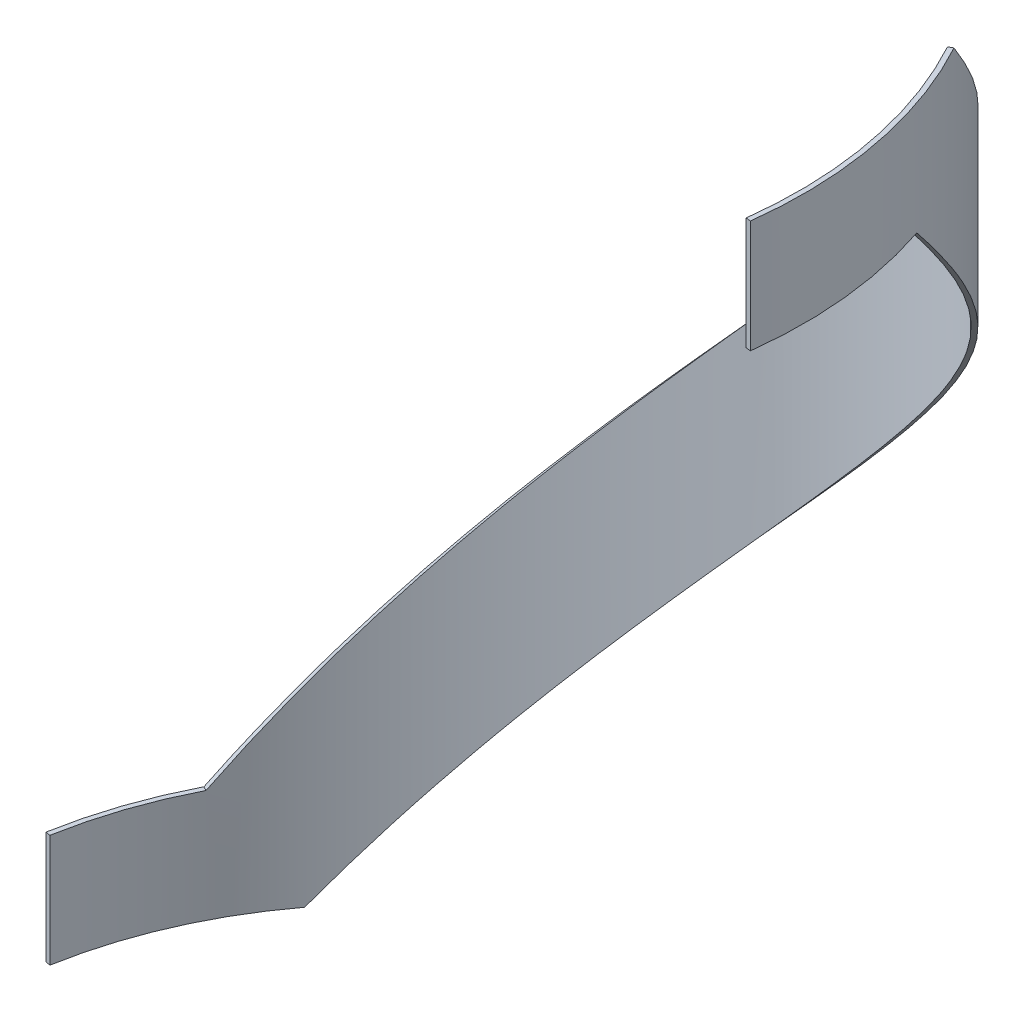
ISO-10303-21;
HEADER;
FILE_DESCRIPTION(('STEP AP214'),'2;1');
FILE_NAME('part.step','',(''),(''),'','','');
FILE_SCHEMA(('AUTOMOTIVE_DESIGN { 1 0 10303 214 1 1 1 1 }'));
ENDSEC;
DATA;
#1=APPLICATION_CONTEXT('core data for automotive mechanical design processes');
#2=APPLICATION_PROTOCOL_DEFINITION('international standard','automotive_design',2000,#1);
#3=PRODUCT_CONTEXT('',#1,'mechanical');
#4=PRODUCT('Part','Part','',(#3));
#5=PRODUCT_RELATED_PRODUCT_CATEGORY('part','',(#4));
#6=PRODUCT_DEFINITION_FORMATION('','',#4);
#7=PRODUCT_DEFINITION_CONTEXT('part definition',#1,'design');
#8=PRODUCT_DEFINITION('design','',#6,#7);
#9=PRODUCT_DEFINITION_SHAPE('','',#8);
#10=(LENGTH_UNIT() NAMED_UNIT(*) SI_UNIT(.MILLI.,.METRE.));
#11=(NAMED_UNIT(*) PLANE_ANGLE_UNIT() SI_UNIT($,.RADIAN.));
#12=(NAMED_UNIT(*) SI_UNIT($,.STERADIAN.) SOLID_ANGLE_UNIT());
#13=UNCERTAINTY_MEASURE_WITH_UNIT(LENGTH_MEASURE(1.E-05),#10,'distance_accuracy_value','');
#14=(GEOMETRIC_REPRESENTATION_CONTEXT(3) GLOBAL_UNCERTAINTY_ASSIGNED_CONTEXT((#13)) GLOBAL_UNIT_ASSIGNED_CONTEXT((#10,
#11,#12)) REPRESENTATION_CONTEXT('',''));
#15=CARTESIAN_POINT('',(0.,0.,0.));
#16=DIRECTION('',(0.,0.,1.));
#17=DIRECTION('',(1.,0.,0.));
#18=AXIS2_PLACEMENT_3D('',#15,#16,#17);
#19=CARTESIAN_POINT('',(-861.706783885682,-117.5,-151.942155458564));
#20=DIRECTION('',(-0.173648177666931,0.,0.984807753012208));
#21=DIRECTION('',(0.,1.,0.));
#22=AXIS2_PLACEMENT_3D('',#19,#20,#21);
#23=PLANE('',#22);
#24=DIRECTION('',(-0.984807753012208,0.,-0.173648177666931));
#25=VECTOR('',#24,1.);
#26=CARTESIAN_POINT('',(-861.706783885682,-235.,-151.942155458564));
#27=LINE('',#26,#25);
#28=CARTESIAN_POINT('',(-851.85870635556,-235.,-150.205673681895));
#29=VERTEX_POINT('',#28);
#30=CARTESIAN_POINT('',(-861.706783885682,-235.,-151.942155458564));
#31=VERTEX_POINT('',#30);
#32=EDGE_CURVE('E12',#29,#31,#27,.T.);
#33=ORIENTED_EDGE('',*,*,#32,.F.);
#34=DIRECTION('',(0.,-1.,0.));
#35=VECTOR('',#34,1.);
#36=CARTESIAN_POINT('',(-851.85870635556,3445.3749663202,-150.205673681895));
#37=LINE('',#36,#35);
#38=CARTESIAN_POINT('',(-851.85870635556,0.,-150.205673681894));
#39=VERTEX_POINT('',#38);
#40=EDGE_CURVE('E102',#29,#39,#37,.F.);
#41=ORIENTED_EDGE('',*,*,#40,.T.);
#42=DIRECTION('',(-0.984807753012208,0.,-0.17364817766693));
#43=VECTOR('',#42,1.);
#44=CARTESIAN_POINT('',(-861.706783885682,0.,-151.942155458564));
#45=LINE('',#44,#43);
#46=CARTESIAN_POINT('',(-861.706783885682,0.,-151.942155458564));
#47=VERTEX_POINT('',#46);
#48=EDGE_CURVE('E61',#39,#47,#45,.T.);
#49=ORIENTED_EDGE('',*,*,#48,.T.);
#50=DIRECTION('',(0.,1.,0.));
#51=VECTOR('',#50,1.);
#52=CARTESIAN_POINT('',(-861.706783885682,-235.,-151.942155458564));
#53=LINE('',#52,#51);
#54=EDGE_CURVE('E105',#31,#47,#53,.T.);
#55=ORIENTED_EDGE('',*,*,#54,.F.);
#56=EDGE_LOOP('',(#33,#41,#49,#55));
#57=FACE_BOUND('',#56,.T.);
#58=ADVANCED_FACE('F49',(#57),#23,.T.);
#59=CARTESIAN_POINT('',(1.11022302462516E-13,0.,0.));
#60=DIRECTION('',(0.,1.,0.));
#61=DIRECTION('',(0.,0.,1.));
#62=AXIS2_PLACEMENT_3D('',#59,#60,#61);
#63=PLANE('',#62);
#64=ORIENTED_EDGE('',*,*,#48,.F.);
#65=CARTESIAN_POINT('',(1.11022302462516E-13,0.,0.));
#66=DIRECTION('',(0.,-1.,0.));
#67=DIRECTION('',(0.,0.,-1.));
#68=AXIS2_PLACEMENT_3D('',#65,#66,#67);
#69=CIRCLE('',#68,865.);
#70=CARTESIAN_POINT('',(-769.87668269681,0.,-394.353766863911));
#71=VERTEX_POINT('',#70);
#72=EDGE_CURVE('E118',#39,#71,#69,.T.);
#73=ORIENTED_EDGE('',*,*,#72,.T.);
#74=CARTESIAN_POINT('',(-778.776991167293,0.,-398.912769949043));
#75=CARTESIAN_POINT('',(-769.87668269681,0.,-394.353766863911));
#76=B_SPLINE_CURVE_WITH_KNOTS('',1,(#74,#75),.UNSPECIFIED.,.F.,.F.,(2,2),(0.,1.),.UNSPECIFIED.);
#77=CARTESIAN_POINT('',(-778.776991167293,0.,-398.912769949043));
#78=VERTEX_POINT('',#77);
#79=EDGE_CURVE('E330',#71,#78,#76,.F.);
#80=ORIENTED_EDGE('',*,*,#79,.T.);
#81=CARTESIAN_POINT('',(1.11022302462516E-13,0.,0.));
#82=DIRECTION('',(0.,-1.,0.));
#83=DIRECTION('',(0.,0.,1.));
#84=AXIS2_PLACEMENT_3D('',#81,#82,#83);
#85=CIRCLE('',#84,875.);
#86=EDGE_CURVE('E122',#47,#78,#85,.T.);
#87=ORIENTED_EDGE('',*,*,#86,.F.);
#88=EDGE_LOOP('',(#64,#73,#80,#87));
#89=FACE_BOUND('',#88,.T.);
#90=ADVANCED_FACE('F212',(#89),#63,.T.);
#91=CARTESIAN_POINT('',(-778.776991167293,0.,-398.912769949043));
#92=CARTESIAN_POINT('',(-760.754896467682,43.7500507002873,-434.0963833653));
#93=CARTESIAN_POINT('',(-740.345017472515,87.5000000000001,-468.056550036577));
#94=CARTESIAN_POINT('',(-695.12345401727,175.,-532.908118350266));
#95=CARTESIAN_POINT('',(-670.312044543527,218.75,-563.799114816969));
#96=CARTESIAN_POINT('',(-616.742489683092,306.25,-621.945640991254));
#97=CARTESIAN_POINT('',(-587.984645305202,350.,-649.200843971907));
#98=CARTESIAN_POINT('',(-527.049636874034,437.5,-699.575842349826));
#99=CARTESIAN_POINT('',(-494.872815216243,481.25,-722.695354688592));
#100=CARTESIAN_POINT('',(-427.689983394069,568.75,-764.37487990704));
#101=CARTESIAN_POINT('',(-392.684350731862,612.5,-782.934658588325));
#102=CARTESIAN_POINT('',(-320.485919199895,700.,-815.154251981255));
#103=CARTESIAN_POINT('',(-283.293526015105,743.75,-828.81388565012));
#104=CARTESIAN_POINT('',(-207.403711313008,831.25,-850.98259645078));
#105=CARTESIAN_POINT('',(-168.706716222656,875.,-859.49154901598));
#106=CARTESIAN_POINT('',(-90.5174398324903,962.5,-871.202773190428));
#107=CARTESIAN_POINT('',(-51.0255978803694,1006.25,-874.404978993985));
#108=CARTESIAN_POINT('',(28.0290434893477,1093.75,-875.44391690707));
#109=CARTESIAN_POINT('',(67.5913986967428,1137.5,-873.280643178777));
#110=CARTESIAN_POINT('',(146.061436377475,1225.,-863.628239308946));
#111=CARTESIAN_POINT('',(184.968677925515,1268.75,-856.13916340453));
#112=CARTESIAN_POINT('',(261.41486566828,1356.25,-835.972455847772));
#113=CARTESIAN_POINT('',(298.953382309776,1400.,-823.294937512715));
#114=CARTESIAN_POINT('',(371.973594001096,1487.5,-792.983810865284));
#115=CARTESIAN_POINT('',(407.454878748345,1531.25,-775.350372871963));
#116=CARTESIAN_POINT('',(475.709825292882,1618.75,-735.450774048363));
#117=CARTESIAN_POINT('',(508.483103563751,1662.5,-713.184837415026));
#118=CARTESIAN_POINT('',(570.72089725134,1750.,-664.428578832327));
#119=CARTESIAN_POINT('',(600.185062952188,1793.75,-637.938530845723));
#120=CARTESIAN_POINT('',(655.264178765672,1881.25,-581.219867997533));
#121=CARTESIAN_POINT('',(680.878819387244,1925.,-550.991571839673));
#122=CARTESIAN_POINT('',(727.78903210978,2012.5,-487.350801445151));
#123=CARTESIAN_POINT('',(749.084318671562,2056.24994929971,-453.938725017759));
#124=CARTESIAN_POINT('',(768.0247971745,2100.,-419.24087458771));
#125=CARTESIAN_POINT('',(-769.87668269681,0.,-394.353766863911));
#126=CARTESIAN_POINT('',(-752.060555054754,43.7500500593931,-429.135281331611));
#127=CARTESIAN_POINT('',(-731.883931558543,87.5000000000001,-462.707332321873));
#128=CARTESIAN_POINT('',(-687.179185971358,175.,-526.817739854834));
#129=CARTESIAN_POINT('',(-662.651335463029,218.75,-557.355696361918));
#130=CARTESIAN_POINT('',(-609.694004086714,306.25,-614.837690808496));
#131=CARTESIAN_POINT('',(-581.264820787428,350.,-641.781405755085));
#132=CARTESIAN_POINT('',(-521.026212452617,437.5,-691.580689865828));
#133=CARTESIAN_POINT('',(-489.217125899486,481.25,-714.435979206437));
#134=CARTESIAN_POINT('',(-422.802097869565,568.75,-755.639166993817));
#135=CARTESIAN_POINT('',(-388.19652958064,612.5,-773.986833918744));
#136=CARTESIAN_POINT('',(-316.823222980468,700.,-805.838203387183));
#137=CARTESIAN_POINT('',(-280.055885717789,743.75,-819.341726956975));
#138=CARTESIAN_POINT('',(-205.033383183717,831.25,-841.257081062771));
#139=CARTESIAN_POINT('',(-166.778639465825,875.,-849.668788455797));
#140=CARTESIAN_POINT('',(-89.4829548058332,962.5,-861.246170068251));
#141=CARTESIAN_POINT('',(-50.442448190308,1006.25,-864.411779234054));
#142=CARTESIAN_POINT('',(27.7087115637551,1093.75,-865.438843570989));
#143=CARTESIAN_POINT('',(66.81892556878,1137.5,-863.30029297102));
#144=CARTESIAN_POINT('',(144.392162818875,1225.,-853.758202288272));
#145=CARTESIAN_POINT('',(182.854750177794,1268.75,-846.354715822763));
#146=CARTESIAN_POINT('',(258.427267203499,1356.25,-826.418484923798));
#147=CARTESIAN_POINT('',(295.536772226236,1400.,-813.88585251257));
#148=CARTESIAN_POINT('',(367.722467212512,1487.5,-783.921138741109));
#149=CARTESIAN_POINT('',(402.798251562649,1531.25,-766.489225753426));
#150=CARTESIAN_POINT('',(470.273141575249,1618.75,-727.045622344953));
#151=CARTESIAN_POINT('',(502.671868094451,1662.5,-705.034153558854));
#152=CARTESIAN_POINT('',(564.198372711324,1750.,-656.835109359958));
#153=CARTESIAN_POINT('',(593.325805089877,1793.75,-630.647804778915));
#154=CARTESIAN_POINT('',(647.775445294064,1881.25,-574.577355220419));
#155=CARTESIAN_POINT('',(673.097347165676,1925.,-544.694525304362));
#156=CARTESIAN_POINT('',(719.471443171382,2012.5,-481.781078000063));
#157=CARTESIAN_POINT('',(740.523355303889,2056.24994994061,-448.75085337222));
#158=CARTESIAN_POINT('',(759.247370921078,2100.,-414.449550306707));
#159=B_SPLINE_SURFACE_WITH_KNOTS('',1,3,((#91,#92,#93,#94,#95,#96,#97,#98,#99,#100,#101,#102,
#103,#104,#105,#106,#107,#108,#109,#110,#111,#112,#113,#114,#115,#116,#117,#118,#119,#120,#121,
#122,#123,#124),(#125,#126,#127,#128,#129,#130,#131,#132,#133,#134,#135,#136,#137,#138,#139,
#140,#141,#142,#143,#144,#145,#146,#147,#148,#149,#150,#151,#152,#153,#154,#155,#156,#157,
#158)),.UNSPECIFIED.,.F.,.F.,.F.,(2,2),(4,2,2,2,2,2,2,2,2,2,2,2,2,2,2,2,4),(0.,1.),(0.,0.0625,
0.125,0.1875,0.25,0.3125,0.375,0.4375,0.5,0.5625,0.625,0.6875,0.75,0.8125,0.875,0.9375,1.),.UNSPECIFIED.);
#160=CARTESIAN_POINT('',(-769.87668269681,0.,-394.353766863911));
#161=CARTESIAN_POINT('',(-752.060555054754,43.7500500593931,-429.135281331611));
#162=CARTESIAN_POINT('',(-731.883931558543,87.5000000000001,-462.707332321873));
#163=CARTESIAN_POINT('',(-687.179185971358,175.,-526.817739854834));
#164=CARTESIAN_POINT('',(-662.651335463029,218.75,-557.355696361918));
#165=CARTESIAN_POINT('',(-609.694004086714,306.25,-614.837690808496));
#166=CARTESIAN_POINT('',(-581.264820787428,350.,-641.781405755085));
#167=CARTESIAN_POINT('',(-521.026212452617,437.5,-691.580689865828));
#168=CARTESIAN_POINT('',(-489.217125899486,481.25,-714.435979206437));
#169=CARTESIAN_POINT('',(-422.802097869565,568.75,-755.639166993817));
#170=CARTESIAN_POINT('',(-388.19652958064,612.5,-773.986833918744));
#171=CARTESIAN_POINT('',(-316.823222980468,700.,-805.838203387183));
#172=CARTESIAN_POINT('',(-280.055885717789,743.75,-819.341726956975));
#173=CARTESIAN_POINT('',(-205.033383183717,831.25,-841.257081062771));
#174=CARTESIAN_POINT('',(-166.778639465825,875.,-849.668788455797));
#175=CARTESIAN_POINT('',(-89.4829548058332,962.5,-861.246170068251));
#176=CARTESIAN_POINT('',(-50.442448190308,1006.25,-864.411779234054));
#177=CARTESIAN_POINT('',(27.7087115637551,1093.75,-865.438843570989));
#178=CARTESIAN_POINT('',(66.81892556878,1137.5,-863.30029297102));
#179=CARTESIAN_POINT('',(144.392162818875,1225.,-853.758202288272));
#180=CARTESIAN_POINT('',(182.854750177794,1268.75,-846.354715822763));
#181=CARTESIAN_POINT('',(258.427267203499,1356.25,-826.418484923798));
#182=CARTESIAN_POINT('',(295.536772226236,1400.,-813.88585251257));
#183=CARTESIAN_POINT('',(367.722467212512,1487.5,-783.921138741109));
#184=CARTESIAN_POINT('',(402.798251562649,1531.25,-766.489225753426));
#185=CARTESIAN_POINT('',(470.273141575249,1618.75,-727.045622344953));
#186=CARTESIAN_POINT('',(502.671868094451,1662.5,-705.034153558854));
#187=CARTESIAN_POINT('',(564.198372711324,1750.,-656.835109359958));
#188=CARTESIAN_POINT('',(593.325805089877,1793.75,-630.647804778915));
#189=CARTESIAN_POINT('',(647.775445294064,1881.25,-574.577355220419));
#190=CARTESIAN_POINT('',(673.097347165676,1925.,-544.694525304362));
#191=CARTESIAN_POINT('',(719.471443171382,2012.5,-481.781078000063));
#192=CARTESIAN_POINT('',(740.523355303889,2056.24994994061,-448.75085337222));
#193=CARTESIAN_POINT('',(759.247370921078,2100.,-414.449550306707));
#194=B_SPLINE_CURVE_WITH_KNOTS('',3,(#160,#161,#162,#163,#164,#165,#166,#167,#168,#169,#170,
#171,#172,#173,#174,#175,#176,#177,#178,#179,#180,#181,#182,#183,#184,#185,#186,#187,#188,#189,
#190,#191,#192,#193),.UNSPECIFIED.,.F.,.F.,(4,2,2,2,2,2,2,2,2,2,2,2,2,2,2,2,4),(0.,0.0625,0.125,
0.1875,0.25,0.3125,0.375,0.4375,0.5,0.5625,0.625,0.6875,0.75,0.8125,0.875,0.9375,1.),.UNSPECIFIED.);
#195=CARTESIAN_POINT('',(759.247370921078,2100.,-414.449550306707));
#196=VERTEX_POINT('',#195);
#197=EDGE_CURVE('E284',#71,#196,#194,.T.);
#198=CARTESIAN_POINT('',(759.247370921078,2100.,-414.449550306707));
#199=CARTESIAN_POINT('',(768.0247971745,2100.,-419.24087458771));
#200=B_SPLINE_CURVE_WITH_KNOTS('',1,(#198,#199),.UNSPECIFIED.,.F.,.F.,(2,2),(0.,1.),.UNSPECIFIED.);
#201=CARTESIAN_POINT('',(768.0247971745,2100.,-419.24087458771));
#202=VERTEX_POINT('',#201);
#203=EDGE_CURVE('E186',#196,#202,#200,.T.);
#204=CARTESIAN_POINT('',(768.0247971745,2100.,-419.24087458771));
#205=CARTESIAN_POINT('',(749.084318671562,2056.24994929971,-453.938725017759));
#206=CARTESIAN_POINT('',(727.78903210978,2012.5,-487.350801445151));
#207=CARTESIAN_POINT('',(680.878819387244,1925.,-550.991571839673));
#208=CARTESIAN_POINT('',(655.264178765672,1881.25,-581.219867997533));
#209=CARTESIAN_POINT('',(600.185062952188,1793.75,-637.938530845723));
#210=CARTESIAN_POINT('',(570.72089725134,1750.,-664.428578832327));
#211=CARTESIAN_POINT('',(508.483103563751,1662.5,-713.184837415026));
#212=CARTESIAN_POINT('',(475.709825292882,1618.75,-735.450774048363));
#213=CARTESIAN_POINT('',(407.454878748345,1531.25,-775.350372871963));
#214=CARTESIAN_POINT('',(371.973594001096,1487.5,-792.983810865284));
#215=CARTESIAN_POINT('',(298.953382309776,1400.,-823.294937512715));
#216=CARTESIAN_POINT('',(261.41486566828,1356.25,-835.972455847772));
#217=CARTESIAN_POINT('',(184.968677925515,1268.75,-856.13916340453));
#218=CARTESIAN_POINT('',(146.061436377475,1225.,-863.628239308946));
#219=CARTESIAN_POINT('',(67.5913986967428,1137.5,-873.280643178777));
#220=CARTESIAN_POINT('',(28.0290434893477,1093.75,-875.44391690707));
#221=CARTESIAN_POINT('',(-51.0255978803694,1006.25,-874.404978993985));
#222=CARTESIAN_POINT('',(-90.5174398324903,962.5,-871.202773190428));
#223=CARTESIAN_POINT('',(-168.706716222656,875.,-859.49154901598));
#224=CARTESIAN_POINT('',(-207.403711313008,831.25,-850.98259645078));
#225=CARTESIAN_POINT('',(-283.293526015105,743.75,-828.81388565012));
#226=CARTESIAN_POINT('',(-320.485919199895,700.,-815.154251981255));
#227=CARTESIAN_POINT('',(-392.684350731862,612.5,-782.934658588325));
#228=CARTESIAN_POINT('',(-427.689983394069,568.75,-764.37487990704));
#229=CARTESIAN_POINT('',(-494.872815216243,481.25,-722.695354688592));
#230=CARTESIAN_POINT('',(-527.049636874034,437.5,-699.575842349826));
#231=CARTESIAN_POINT('',(-587.984645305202,350.,-649.200843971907));
#232=CARTESIAN_POINT('',(-616.742489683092,306.25,-621.945640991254));
#233=CARTESIAN_POINT('',(-670.312044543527,218.75,-563.799114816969));
#234=CARTESIAN_POINT('',(-695.12345401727,175.,-532.908118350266));
#235=CARTESIAN_POINT('',(-740.345017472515,87.5000000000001,-468.056550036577));
#236=CARTESIAN_POINT('',(-760.754896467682,43.7500507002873,-434.0963833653));
#237=CARTESIAN_POINT('',(-778.776991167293,0.,-398.912769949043));
#238=B_SPLINE_CURVE_WITH_KNOTS('',3,(#204,#205,#206,#207,#208,#209,#210,#211,#212,#213,#214,
#215,#216,#217,#218,#219,#220,#221,#222,#223,#224,#225,#226,#227,#228,#229,#230,#231,#232,#233,
#234,#235,#236,#237),.UNSPECIFIED.,.F.,.F.,(4,2,2,2,2,2,2,2,2,2,2,2,2,2,2,2,4),(0.,0.0625,0.125,
0.1875,0.25,0.3125,0.375,0.4375,0.5,0.5625,0.625,0.6875,0.75,0.8125,0.875,0.9375,1.),.UNSPECIFIED.);
#239=EDGE_CURVE('E310',#78,#202,#238,.F.);
#240=ORIENTED_EDGE('',*,*,#79,.F.);
#241=ORIENTED_EDGE('',*,*,#197,.T.);
#242=ORIENTED_EDGE('',*,*,#203,.T.);
#243=ORIENTED_EDGE('',*,*,#239,.F.);
#244=EDGE_LOOP('',(#240,#241,#242,#243));
#245=FACE_BOUND('',#244,.T.);
#246=ADVANCED_FACE('F199',(#245),#159,.T.);
#247=CARTESIAN_POINT('',(1.11022302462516E-13,2100.,0.));
#248=DIRECTION('',(0.,1.,0.));
#249=DIRECTION('',(0.,0.,1.));
#250=AXIS2_PLACEMENT_3D('',#247,#248,#249);
#251=PLANE('',#250);
#252=ORIENTED_EDGE('',*,*,#203,.F.);
#253=CARTESIAN_POINT('',(1.11022302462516E-13,2100.,0.));
#254=DIRECTION('',(0.,-1.,0.));
#255=DIRECTION('',(0.,0.,-1.));
#256=AXIS2_PLACEMENT_3D('',#253,#254,#255);
#257=CIRCLE('',#256,865.);
#258=CARTESIAN_POINT('',(858.552421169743,2100.,105.416982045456));
#259=VERTEX_POINT('',#258);
#260=EDGE_CURVE('E279',#196,#259,#257,.T.);
#261=ORIENTED_EDGE('',*,*,#260,.T.);
#262=DIRECTION('',(0.992546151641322,0.,0.121869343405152));
#263=VECTOR('',#262,1.);
#264=CARTESIAN_POINT('',(868.477882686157,2100.,106.635675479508));
#265=LINE('',#264,#263);
#266=CARTESIAN_POINT('',(868.477882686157,2100.,106.635675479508));
#267=VERTEX_POINT('',#266);
#268=EDGE_CURVE('E182',#259,#267,#265,.T.);
#269=ORIENTED_EDGE('',*,*,#268,.T.);
#270=CARTESIAN_POINT('',(1.11022302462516E-13,2100.,0.));
#271=DIRECTION('',(0.,-1.,0.));
#272=DIRECTION('',(0.,0.,-1.));
#273=AXIS2_PLACEMENT_3D('',#270,#271,#272);
#274=CIRCLE('',#273,875.);
#275=EDGE_CURVE('E260',#202,#267,#274,.T.);
#276=ORIENTED_EDGE('',*,*,#275,.F.);
#277=EDGE_LOOP('',(#252,#261,#269,#276));
#278=FACE_BOUND('',#277,.T.);
#279=ADVANCED_FACE('F211',(#278),#251,.T.);
#280=CARTESIAN_POINT('',(868.477882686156,1982.5,106.635675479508));
#281=DIRECTION('',(-0.121869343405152,0.,0.992546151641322));
#282=DIRECTION('',(0.,-1.,0.));
#283=AXIS2_PLACEMENT_3D('',#280,#281,#282);
#284=PLANE('',#283);
#285=ORIENTED_EDGE('',*,*,#268,.F.);
#286=DIRECTION('',(0.,-1.,0.));
#287=VECTOR('',#286,1.);
#288=CARTESIAN_POINT('',(858.552421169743,3445.3749663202,105.416982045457));
#289=LINE('',#288,#287);
#290=CARTESIAN_POINT('',(858.552421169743,1865.,105.416982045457));
#291=VERTEX_POINT('',#290);
#292=EDGE_CURVE('E277',#259,#291,#289,.T.);
#293=ORIENTED_EDGE('',*,*,#292,.T.);
#294=DIRECTION('',(0.992546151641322,0.,0.121869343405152));
#295=VECTOR('',#294,1.);
#296=CARTESIAN_POINT('',(868.477882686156,1865.,106.635675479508));
#297=LINE('',#296,#295);
#298=CARTESIAN_POINT('',(868.477882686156,1865.,106.635675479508));
#299=VERTEX_POINT('',#298);
#300=EDGE_CURVE('E174',#291,#299,#297,.T.);
#301=ORIENTED_EDGE('',*,*,#300,.T.);
#302=DIRECTION('',(0.,-1.,0.));
#303=VECTOR('',#302,1.);
#304=CARTESIAN_POINT('',(868.477882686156,2100.,106.635675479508));
#305=LINE('',#304,#303);
#306=EDGE_CURVE('E256',#267,#299,#305,.T.);
#307=ORIENTED_EDGE('',*,*,#306,.F.);
#308=EDGE_LOOP('',(#285,#293,#301,#307));
#309=FACE_BOUND('',#308,.T.);
#310=ADVANCED_FACE('F339',(#309),#284,.T.);
#311=CARTESIAN_POINT('',(1.11022302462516E-13,1865.,0.));
#312=DIRECTION('',(0.,-1.,0.));
#313=DIRECTION('',(0.,0.,-1.));
#314=AXIS2_PLACEMENT_3D('',#311,#312,#313);
#315=PLANE('',#314);
#316=ORIENTED_EDGE('',*,*,#300,.F.);
#317=CARTESIAN_POINT('',(1.11022302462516E-13,1865.,0.));
#318=DIRECTION('',(0.,-1.,0.));
#319=DIRECTION('',(0.,0.,-1.));
#320=AXIS2_PLACEMENT_3D('',#317,#318,#319);
#321=CIRCLE('',#320,865.);
#322=CARTESIAN_POINT('',(819.25048614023,1865.,-277.58537598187));
#323=VERTEX_POINT('',#322);
#324=EDGE_CURVE('E124',#291,#323,#321,.F.);
#325=ORIENTED_EDGE('',*,*,#324,.T.);
#326=CARTESIAN_POINT('',(828.721590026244,1865.,-280.794455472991));
#327=CARTESIAN_POINT('',(819.25048614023,1865.,-277.585375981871));
#328=B_SPLINE_CURVE_WITH_KNOTS('',1,(#326,#327),.UNSPECIFIED.,.F.,.F.,(2,2),(0.,1.),.UNSPECIFIED.);
#329=CARTESIAN_POINT('',(828.721590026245,1865.,-280.79445547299));
#330=VERTEX_POINT('',#329);
#331=EDGE_CURVE('E183',#323,#330,#328,.F.);
#332=ORIENTED_EDGE('',*,*,#331,.T.);
#333=CARTESIAN_POINT('',(1.11022302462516E-13,1865.,0.));
#334=DIRECTION('',(0.,1.,0.));
#335=DIRECTION('',(0.,0.,-1.));
#336=AXIS2_PLACEMENT_3D('',#333,#334,#335);
#337=CIRCLE('',#336,875.);
#338=EDGE_CURVE('E249',#299,#330,#337,.T.);
#339=ORIENTED_EDGE('',*,*,#338,.F.);
#340=EDGE_LOOP('',(#316,#325,#332,#339));
#341=FACE_BOUND('',#340,.T.);
#342=ADVANCED_FACE('F150',(#341),#315,.T.);
#343=CARTESIAN_POINT('',(828.721590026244,1865.,-280.794455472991));
#344=CARTESIAN_POINT('',(816.035848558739,1821.24994929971,-318.234467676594));
#345=CARTESIAN_POINT('',(800.80913766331,1777.5,-354.813195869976));
#346=CARTESIAN_POINT('',(765.552626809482,1690.,-425.57825897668));
#347=CARTESIAN_POINT('',(745.523039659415,1646.25,-459.764152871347));
#348=CARTESIAN_POINT('',(701.028123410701,1558.75,-525.116414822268));
#349=CARTESIAN_POINT('',(676.563044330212,1515.,-556.282415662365));
#350=CARTESIAN_POINT('',(623.645819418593,1427.5,-615.023227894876));
#351=CARTESIAN_POINT('',(595.193970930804,1383.75,-642.59770922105));
#352=CARTESIAN_POINT('',(534.825010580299,1296.25,-693.649686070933));
#353=CARTESIAN_POINT('',(502.908237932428,1252.5,-717.126894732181));
#354=CARTESIAN_POINT('',(436.194790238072,1165.,-759.553674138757));
#355=CARTESIAN_POINT('',(401.398490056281,1121.25,-778.503006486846));
#356=CARTESIAN_POINT('',(329.564169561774,1033.75,-811.526424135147));
#357=CARTESIAN_POINT('',(292.526552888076,990.,-825.600323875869));
#358=CARTESIAN_POINT('',(216.888897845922,902.500000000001,-848.614685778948));
#359=CARTESIAN_POINT('',(178.289284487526,858.75,-857.555018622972));
#360=CARTESIAN_POINT('',(100.235591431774,771.25,-870.138210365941));
#361=CARTESIAN_POINT('',(60.7819503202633,727.5,-873.780998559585));
#362=CARTESIAN_POINT('',(-18.256170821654,640.,-875.702227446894));
#363=CARTESIAN_POINT('',(-57.840206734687,596.25,-873.980657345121));
#364=CARTESIAN_POINT('',(-136.413090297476,508.75,-865.204685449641));
#365=CARTESIAN_POINT('',(-175.401496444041,465.,-858.150332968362));
#366=CARTESIAN_POINT('',(-252.068009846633,377.5,-838.838123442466));
#367=CARTESIAN_POINT('',(-289.745686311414,333.75,-826.580374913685));
#368=CARTESIAN_POINT('',(-363.099662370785,246.25,-797.086139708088));
#369=CARTESIAN_POINT('',(-398.775549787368,202.5,-779.849818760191));
#370=CARTESIAN_POINT('',(-467.47157771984,115.,-740.714521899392));
#371=CARTESIAN_POINT('',(-500.49133223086,71.2500000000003,-718.815765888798));
#372=CARTESIAN_POINT('',(-563.269434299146,-16.2499999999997,-670.757201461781));
#373=CARTESIAN_POINT('',(-593.027429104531,-60.0000000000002,-644.597663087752));
#374=CARTESIAN_POINT('',(-648.736170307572,-147.5,-588.497289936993));
#375=CARTESIAN_POINT('',(-674.686576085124,-191.249949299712,-558.556806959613));
#376=CARTESIAN_POINT('',(-698.495407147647,-235.,-527.000157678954));
#377=CARTESIAN_POINT('',(819.25048614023,1865.,-277.585375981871));
#378=CARTESIAN_POINT('',(806.70972475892,1821.24994994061,-314.597501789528));
#379=CARTESIAN_POINT('',(791.657033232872,1777.5,-350.758187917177));
#380=CARTESIAN_POINT('',(756.80345393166,1690.,-420.714507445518));
#381=CARTESIAN_POINT('',(737.002776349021,1646.25,-454.50970540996));
#382=CARTESIAN_POINT('',(693.016373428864,1558.75,-519.115084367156));
#383=CARTESIAN_POINT('',(668.830895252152,1515.,-549.92490234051));
#384=CARTESIAN_POINT('',(616.518438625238,1427.5,-607.994391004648));
#385=CARTESIAN_POINT('',(588.391754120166,1383.75,-635.253735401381));
#386=CARTESIAN_POINT('',(528.712724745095,1296.25,-685.722261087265));
#387=CARTESIAN_POINT('',(497.1607152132,1252.5,-708.931158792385));
#388=CARTESIAN_POINT('',(431.209706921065,1165.,-750.873060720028));
#389=CARTESIAN_POINT('',(396.811078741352,1121.25,-769.605829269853));
#390=CARTESIAN_POINT('',(325.797721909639,1033.75,-802.251836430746));
#391=CARTESIAN_POINT('',(289.183392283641,990.,-816.164891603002));
#392=CARTESIAN_POINT('',(214.410167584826,902.500000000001,-838.916232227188));
#393=CARTESIAN_POINT('',(176.251692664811,858.75,-847.75438983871));
#394=CARTESIAN_POINT('',(99.0900418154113,771.25,-860.193773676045));
#395=CARTESIAN_POINT('',(60.0872994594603,727.5,-863.794930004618));
#396=CARTESIAN_POINT('',(-18.0475288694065,640.,-865.694201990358));
#397=CARTESIAN_POINT('',(-57.1791758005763,596.25,-863.992306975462));
#398=CARTESIAN_POINT('',(-134.854083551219,508.75,-855.316631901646));
#399=CARTESIAN_POINT('',(-173.396907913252,465.,-848.342900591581));
#400=CARTESIAN_POINT('',(-249.187232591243,377.5,-829.251402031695));
#401=CARTESIAN_POINT('',(-286.434307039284,333.750000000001,-817.133742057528));
#402=CARTESIAN_POINT('',(-358.949951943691,246.25,-787.97658382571));
#403=CARTESIAN_POINT('',(-394.218114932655,202.5,-770.937249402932));
#404=CARTESIAN_POINT('',(-462.129045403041,115.,-732.249213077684));
#405=CARTESIAN_POINT('',(-494.771431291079,71.2500000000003,-710.600728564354));
#406=CARTESIAN_POINT('',(-556.832069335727,-16.2499999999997,-663.091404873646));
#407=CARTESIAN_POINT('',(-586.249972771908,-60.0000000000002,-637.230832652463));
#408=CARTESIAN_POINT('',(-641.322042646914,-147.5,-581.771606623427));
#409=CARTESIAN_POINT('',(-666.975872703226,-191.249949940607,-552.173300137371));
#410=CARTESIAN_POINT('',(-690.512602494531,-235.,-520.977298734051));
#411=B_SPLINE_SURFACE_WITH_KNOTS('',1,3,((#343,#344,#345,#346,#347,#348,#349,#350,#351,#352,
#353,#354,#355,#356,#357,#358,#359,#360,#361,#362,#363,#364,#365,#366,#367,#368,#369,#370,#371,
#372,#373,#374,#375,#376),(#377,#378,#379,#380,#381,#382,#383,#384,#385,#386,#387,#388,#389,
#390,#391,#392,#393,#394,#395,#396,#397,#398,#399,#400,#401,#402,#403,#404,#405,#406,#407,#408,
#409,#410)),.UNSPECIFIED.,.F.,.F.,.F.,(2,2),(4,2,2,2,2,2,2,2,2,2,2,2,2,2,2,2,4),(0.,1.),(0.,
0.0625,0.125,0.1875,0.25,0.3125,0.375,0.4375,0.5,0.5625,0.625,0.6875,0.75,0.8125,0.875,0.9375,
1.),.UNSPECIFIED.);
#412=CARTESIAN_POINT('',(819.25048614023,1865.,-277.585375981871));
#413=CARTESIAN_POINT('',(806.70972475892,1821.24994994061,-314.597501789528));
#414=CARTESIAN_POINT('',(791.657033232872,1777.5,-350.758187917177));
#415=CARTESIAN_POINT('',(756.80345393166,1690.,-420.714507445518));
#416=CARTESIAN_POINT('',(737.002776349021,1646.25,-454.50970540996));
#417=CARTESIAN_POINT('',(693.016373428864,1558.75,-519.115084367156));
#418=CARTESIAN_POINT('',(668.830895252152,1515.,-549.92490234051));
#419=CARTESIAN_POINT('',(616.518438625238,1427.5,-607.994391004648));
#420=CARTESIAN_POINT('',(588.391754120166,1383.75,-635.253735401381));
#421=CARTESIAN_POINT('',(528.712724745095,1296.25,-685.722261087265));
#422=CARTESIAN_POINT('',(497.1607152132,1252.5,-708.931158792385));
#423=CARTESIAN_POINT('',(431.209706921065,1165.,-750.873060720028));
#424=CARTESIAN_POINT('',(396.811078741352,1121.25,-769.605829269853));
#425=CARTESIAN_POINT('',(325.797721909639,1033.75,-802.251836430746));
#426=CARTESIAN_POINT('',(289.183392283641,990.,-816.164891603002));
#427=CARTESIAN_POINT('',(214.410167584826,902.500000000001,-838.916232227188));
#428=CARTESIAN_POINT('',(176.251692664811,858.75,-847.75438983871));
#429=CARTESIAN_POINT('',(99.0900418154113,771.25,-860.193773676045));
#430=CARTESIAN_POINT('',(60.0872994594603,727.5,-863.794930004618));
#431=CARTESIAN_POINT('',(-18.0475288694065,640.,-865.694201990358));
#432=CARTESIAN_POINT('',(-57.1791758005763,596.25,-863.992306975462));
#433=CARTESIAN_POINT('',(-134.854083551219,508.75,-855.316631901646));
#434=CARTESIAN_POINT('',(-173.396907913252,465.,-848.342900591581));
#435=CARTESIAN_POINT('',(-249.187232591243,377.5,-829.251402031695));
#436=CARTESIAN_POINT('',(-286.434307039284,333.750000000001,-817.133742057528));
#437=CARTESIAN_POINT('',(-358.949951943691,246.25,-787.97658382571));
#438=CARTESIAN_POINT('',(-394.218114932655,202.5,-770.937249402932));
#439=CARTESIAN_POINT('',(-462.129045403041,115.,-732.249213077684));
#440=CARTESIAN_POINT('',(-494.771431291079,71.2500000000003,-710.600728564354));
#441=CARTESIAN_POINT('',(-556.832069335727,-16.2499999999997,-663.091404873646));
#442=CARTESIAN_POINT('',(-586.249972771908,-60.0000000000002,-637.230832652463));
#443=CARTESIAN_POINT('',(-641.322042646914,-147.5,-581.771606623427));
#444=CARTESIAN_POINT('',(-666.975872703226,-191.249949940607,-552.173300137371));
#445=CARTESIAN_POINT('',(-690.512602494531,-235.,-520.977298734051));
#446=B_SPLINE_CURVE_WITH_KNOTS('',3,(#412,#413,#414,#415,#416,#417,#418,#419,#420,#421,#422,
#423,#424,#425,#426,#427,#428,#429,#430,#431,#432,#433,#434,#435,#436,#437,#438,#439,#440,#441,
#442,#443,#444,#445),.UNSPECIFIED.,.F.,.F.,(4,2,2,2,2,2,2,2,2,2,2,2,2,2,2,2,4),(0.,0.0625,0.125,
0.1875,0.25,0.3125,0.375,0.4375,0.5,0.5625,0.625,0.6875,0.75,0.8125,0.875,0.9375,1.),.UNSPECIFIED.);
#447=CARTESIAN_POINT('',(-690.512602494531,-235.,-520.977298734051));
#448=VERTEX_POINT('',#447);
#449=EDGE_CURVE('E120',#323,#448,#446,.T.);
#450=CARTESIAN_POINT('',(-690.512602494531,-235.,-520.977298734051));
#451=CARTESIAN_POINT('',(-698.495407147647,-235.,-527.000157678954));
#452=B_SPLINE_CURVE_WITH_KNOTS('',1,(#450,#451),.UNSPECIFIED.,.F.,.F.,(2,2),(0.,1.),.UNSPECIFIED.);
#453=CARTESIAN_POINT('',(-698.495407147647,-235.,-527.000157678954));
#454=VERTEX_POINT('',#453);
#455=EDGE_CURVE('E70',#448,#454,#452,.T.);
#456=CARTESIAN_POINT('',(-698.495407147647,-235.,-527.000157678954));
#457=CARTESIAN_POINT('',(-674.686576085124,-191.249949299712,-558.556806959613));
#458=CARTESIAN_POINT('',(-648.736170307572,-147.5,-588.497289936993));
#459=CARTESIAN_POINT('',(-593.027429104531,-60.0000000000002,-644.597663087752));
#460=CARTESIAN_POINT('',(-563.269434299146,-16.2499999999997,-670.757201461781));
#461=CARTESIAN_POINT('',(-500.49133223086,71.2500000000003,-718.815765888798));
#462=CARTESIAN_POINT('',(-467.47157771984,115.,-740.714521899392));
#463=CARTESIAN_POINT('',(-398.775549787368,202.5,-779.849818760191));
#464=CARTESIAN_POINT('',(-363.099662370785,246.25,-797.086139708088));
#465=CARTESIAN_POINT('',(-289.745686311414,333.75,-826.580374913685));
#466=CARTESIAN_POINT('',(-252.068009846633,377.5,-838.838123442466));
#467=CARTESIAN_POINT('',(-175.401496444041,465.,-858.150332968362));
#468=CARTESIAN_POINT('',(-136.413090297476,508.75,-865.204685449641));
#469=CARTESIAN_POINT('',(-57.840206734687,596.25,-873.980657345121));
#470=CARTESIAN_POINT('',(-18.256170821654,640.,-875.702227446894));
#471=CARTESIAN_POINT('',(60.7819503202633,727.5,-873.780998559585));
#472=CARTESIAN_POINT('',(100.235591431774,771.25,-870.138210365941));
#473=CARTESIAN_POINT('',(178.289284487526,858.75,-857.555018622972));
#474=CARTESIAN_POINT('',(216.888897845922,902.500000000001,-848.614685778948));
#475=CARTESIAN_POINT('',(292.526552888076,990.,-825.600323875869));
#476=CARTESIAN_POINT('',(329.564169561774,1033.75,-811.526424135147));
#477=CARTESIAN_POINT('',(401.398490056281,1121.25,-778.503006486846));
#478=CARTESIAN_POINT('',(436.194790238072,1165.,-759.553674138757));
#479=CARTESIAN_POINT('',(502.908237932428,1252.5,-717.126894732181));
#480=CARTESIAN_POINT('',(534.825010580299,1296.25,-693.649686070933));
#481=CARTESIAN_POINT('',(595.193970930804,1383.75,-642.59770922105));
#482=CARTESIAN_POINT('',(623.645819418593,1427.5,-615.023227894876));
#483=CARTESIAN_POINT('',(676.563044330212,1515.,-556.282415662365));
#484=CARTESIAN_POINT('',(701.028123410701,1558.75,-525.116414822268));
#485=CARTESIAN_POINT('',(745.523039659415,1646.25,-459.764152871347));
#486=CARTESIAN_POINT('',(765.552626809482,1690.,-425.57825897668));
#487=CARTESIAN_POINT('',(800.80913766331,1777.5,-354.813195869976));
#488=CARTESIAN_POINT('',(816.035848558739,1821.24994929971,-318.234467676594));
#489=CARTESIAN_POINT('',(828.721590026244,1865.,-280.794455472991));
#490=B_SPLINE_CURVE_WITH_KNOTS('',3,(#456,#457,#458,#459,#460,#461,#462,#463,#464,#465,#466,
#467,#468,#469,#470,#471,#472,#473,#474,#475,#476,#477,#478,#479,#480,#481,#482,#483,#484,#485,
#486,#487,#488,#489),.UNSPECIFIED.,.F.,.F.,(4,2,2,2,2,2,2,2,2,2,2,2,2,2,2,2,4),(0.,0.0625,0.125,
0.1875,0.25,0.3125,0.375,0.4375,0.5,0.5625,0.625,0.6875,0.75,0.8125,0.875,0.9375,1.),.UNSPECIFIED.);
#491=EDGE_CURVE('E132',#330,#454,#490,.F.);
#492=ORIENTED_EDGE('',*,*,#331,.F.);
#493=ORIENTED_EDGE('',*,*,#449,.T.);
#494=ORIENTED_EDGE('',*,*,#455,.T.);
#495=ORIENTED_EDGE('',*,*,#491,.F.);
#496=EDGE_LOOP('',(#492,#493,#494,#495));
#497=FACE_BOUND('',#496,.T.);
#498=ADVANCED_FACE('F138',(#497),#411,.T.);
#499=CARTESIAN_POINT('',(1.11022302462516E-13,-235.,0.));
#500=DIRECTION('',(0.,-1.,0.));
#501=DIRECTION('',(0.,0.,-1.));
#502=AXIS2_PLACEMENT_3D('',#499,#500,#501);
#503=PLANE('',#502);
#504=CARTESIAN_POINT('',(1.11022302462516E-13,-235.,0.));
#505=DIRECTION('',(0.,-1.,0.));
#506=DIRECTION('',(0.,0.,-1.));
#507=AXIS2_PLACEMENT_3D('',#504,#505,#506);
#508=CIRCLE('',#507,865.);
#509=EDGE_CURVE('E115',#448,#29,#508,.F.);
#510=ORIENTED_EDGE('',*,*,#509,.T.);
#511=ORIENTED_EDGE('',*,*,#32,.T.);
#512=CARTESIAN_POINT('',(1.11022302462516E-13,-235.,0.));
#513=DIRECTION('',(0.,1.,0.));
#514=DIRECTION('',(0.,0.,1.));
#515=AXIS2_PLACEMENT_3D('',#512,#513,#514);
#516=CIRCLE('',#515,875.);
#517=EDGE_CURVE('E259',#454,#31,#516,.T.);
#518=ORIENTED_EDGE('',*,*,#517,.F.);
#519=ORIENTED_EDGE('',*,*,#455,.F.);
#520=EDGE_LOOP('',(#510,#511,#518,#519));
#521=FACE_BOUND('',#520,.T.);
#522=ADVANCED_FACE('F51',(#521),#503,.T.);
#523=CARTESIAN_POINT('',(1.11022302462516E-13,3445.3749663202,0.));
#524=DIRECTION('',(0.,-1.,0.));
#525=DIRECTION('',(0.,0.,-1.));
#526=AXIS2_PLACEMENT_3D('',#523,#524,#525);
#527=CYLINDRICAL_SURFACE('',#526,875.);
#528=ORIENTED_EDGE('',*,*,#491,.T.);
#529=ORIENTED_EDGE('',*,*,#517,.T.);
#530=ORIENTED_EDGE('',*,*,#54,.T.);
#531=ORIENTED_EDGE('',*,*,#86,.T.);
#532=ORIENTED_EDGE('',*,*,#239,.T.);
#533=ORIENTED_EDGE('',*,*,#275,.T.);
#534=ORIENTED_EDGE('',*,*,#306,.T.);
#535=ORIENTED_EDGE('',*,*,#338,.T.);
#536=EDGE_LOOP('',(#528,#529,#530,#531,#532,#533,#534,#535));
#537=FACE_BOUND('',#536,.T.);
#538=ADVANCED_FACE('F151',(#537),#527,.T.);
#539=CARTESIAN_POINT('',(1.11022302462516E-13,3445.3749663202,0.));
#540=DIRECTION('',(0.,-1.,0.));
#541=DIRECTION('',(0.,0.,-1.));
#542=AXIS2_PLACEMENT_3D('',#539,#540,#541);
#543=CYLINDRICAL_SURFACE('',#542,865.);
#544=ORIENTED_EDGE('',*,*,#449,.F.);
#545=ORIENTED_EDGE('',*,*,#324,.F.);
#546=ORIENTED_EDGE('',*,*,#292,.F.);
#547=ORIENTED_EDGE('',*,*,#260,.F.);
#548=ORIENTED_EDGE('',*,*,#197,.F.);
#549=ORIENTED_EDGE('',*,*,#72,.F.);
#550=ORIENTED_EDGE('',*,*,#40,.F.);
#551=ORIENTED_EDGE('',*,*,#509,.F.);
#552=EDGE_LOOP('',(#544,#545,#546,#547,#548,#549,#550,#551));
#553=FACE_BOUND('',#552,.T.);
#554=ADVANCED_FACE('F114',(#553),#543,.F.);
#555=CLOSED_SHELL('',(#58,#90,#246,#279,#310,#342,#498,#522,#538,#554));
#556=MANIFOLD_SOLID_BREP('B2',#555);
#557=ADVANCED_BREP_SHAPE_REPRESENTATION('',(#18,#556),#14);
#558=SHAPE_DEFINITION_REPRESENTATION(#9,#557);
ENDSEC;
END-ISO-10303-21;
